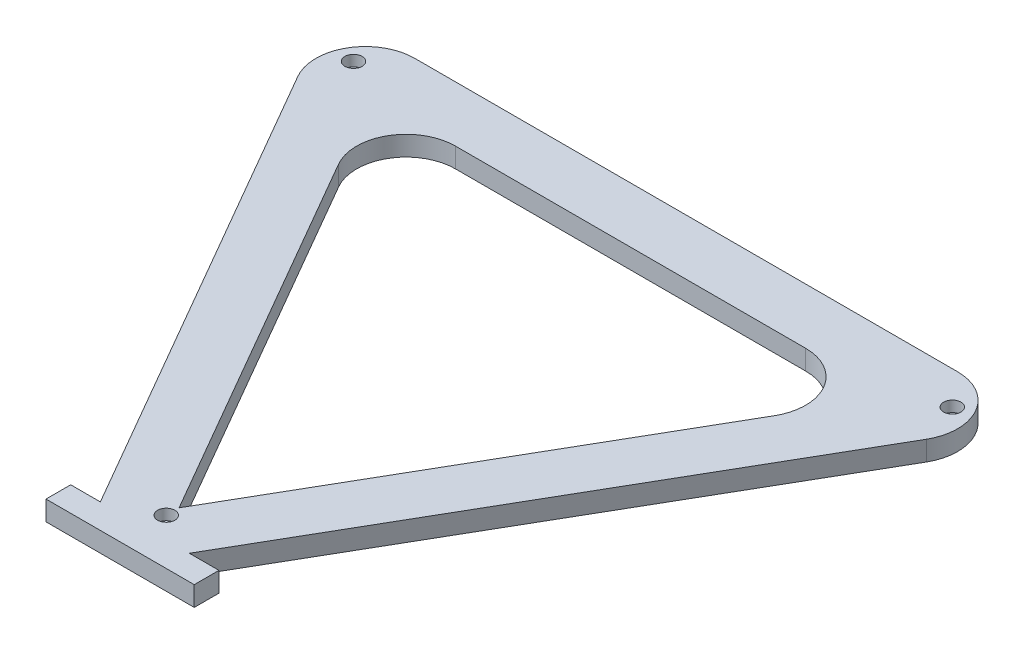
ISO-10303-21;
HEADER;
FILE_DESCRIPTION(('STEP AP214'),'2;1');
FILE_NAME('part.step','',(''),(''),'','','');
FILE_SCHEMA(('AUTOMOTIVE_DESIGN { 1 0 10303 214 1 1 1 1 }'));
ENDSEC;
DATA;
#1=APPLICATION_CONTEXT('core data for automotive mechanical design processes');
#2=APPLICATION_PROTOCOL_DEFINITION('international standard','automotive_design',2000,#1);
#3=PRODUCT_CONTEXT('',#1,'mechanical');
#4=PRODUCT('Part','Part','',(#3));
#5=PRODUCT_RELATED_PRODUCT_CATEGORY('part','',(#4));
#6=PRODUCT_DEFINITION_FORMATION('','',#4);
#7=PRODUCT_DEFINITION_CONTEXT('part definition',#1,'design');
#8=PRODUCT_DEFINITION('design','',#6,#7);
#9=PRODUCT_DEFINITION_SHAPE('','',#8);
#10=(LENGTH_UNIT() NAMED_UNIT(*) SI_UNIT(.MILLI.,.METRE.));
#11=(NAMED_UNIT(*) PLANE_ANGLE_UNIT() SI_UNIT($,.RADIAN.));
#12=(NAMED_UNIT(*) SI_UNIT($,.STERADIAN.) SOLID_ANGLE_UNIT());
#13=UNCERTAINTY_MEASURE_WITH_UNIT(LENGTH_MEASURE(1.E-05),#10,'distance_accuracy_value','');
#14=(GEOMETRIC_REPRESENTATION_CONTEXT(3) GLOBAL_UNCERTAINTY_ASSIGNED_CONTEXT((#13)) GLOBAL_UNIT_ASSIGNED_CONTEXT((#10,
#11,#12)) REPRESENTATION_CONTEXT('',''));
#15=CARTESIAN_POINT('',(0.,0.,0.));
#16=DIRECTION('',(0.,0.,1.));
#17=DIRECTION('',(1.,0.,0.));
#18=AXIS2_PLACEMENT_3D('',#15,#16,#17);
#19=CARTESIAN_POINT('',(13.3772529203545,4.,-25.5556182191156));
#20=DIRECTION('',(0.,1.,0.));
#21=DIRECTION('',(0.,0.,1.));
#22=AXIS2_PLACEMENT_3D('',#19,#20,#21);
#23=PLANE('',#22);
#24=CARTESIAN_POINT('',(-41.5522390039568,4.,69.6664683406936));
#25=DIRECTION('',(0.,1.,0.));
#26=DIRECTION('',(0.,0.,1.));
#27=AXIS2_PLACEMENT_3D('',#24,#25,#26);
#28=CIRCLE('',#27,1.75);
#29=CARTESIAN_POINT('',(-41.5522390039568,4.,71.4164683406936));
#30=VERTEX_POINT('',#29);
#31=EDGE_CURVE('E692',#30,#30,#28,.T.);
#32=ORIENTED_EDGE('',*,*,#31,.F.);
#33=EDGE_LOOP('',(#32));
#34=FACE_BOUND('',#33,.T.);
#35=CARTESIAN_POINT('',(-102.141984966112,4.,-28.8235674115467));
#36=DIRECTION('',(0.,1.,0.));
#37=DIRECTION('',(0.,0.,1.));
#38=AXIS2_PLACEMENT_3D('',#35,#36,#37);
#39=CIRCLE('',#38,1.75);
#40=CARTESIAN_POINT('',(-102.141984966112,4.,-27.0735674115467));
#41=VERTEX_POINT('',#40);
#42=EDGE_CURVE('E696',#41,#41,#39,.T.);
#43=ORIENTED_EDGE('',*,*,#42,.F.);
#44=EDGE_LOOP('',(#43));
#45=FACE_BOUND('',#44,.T.);
#46=CARTESIAN_POINT('',(19.0375069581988,4.,-28.8235674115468));
#47=DIRECTION('',(0.,1.,0.));
#48=DIRECTION('',(0.,0.,1.));
#49=AXIS2_PLACEMENT_3D('',#46,#47,#48);
#50=CIRCLE('',#49,1.75);
#51=CARTESIAN_POINT('',(19.0375069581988,4.,-27.0735674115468));
#52=VERTEX_POINT('',#51);
#53=EDGE_CURVE('E706',#52,#52,#50,.T.);
#54=ORIENTED_EDGE('',*,*,#53,.F.);
#55=EDGE_LOOP('',(#54));
#56=FACE_BOUND('',#55,.T.);
#57=CARTESIAN_POINT('',(13.3772529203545,4.,-25.5556182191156));
#58=DIRECTION('',(0.,1.,0.));
#59=DIRECTION('',(0.,0.,1.));
#60=AXIS2_PLACEMENT_3D('',#57,#58,#59);
#61=CIRCLE('',#60,10.);
#62=CARTESIAN_POINT('',(22.0375069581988,4.,-20.5556182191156));
#63=VERTEX_POINT('',#62);
#64=CARTESIAN_POINT('',(13.3772529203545,4.,-35.5556182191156));
#65=VERTEX_POINT('',#64);
#66=EDGE_CURVE('E278',#63,#65,#61,.T.);
#67=ORIENTED_EDGE('',*,*,#66,.T.);
#68=DIRECTION('',(1.,0.,0.));
#69=VECTOR('',#68,1.);
#70=CARTESIAN_POINT('',(-96.4817309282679,4.,-35.5556182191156));
#71=LINE('',#70,#69);
#72=CARTESIAN_POINT('',(-96.4817309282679,4.,-35.5556182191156));
#73=VERTEX_POINT('',#72);
#74=EDGE_CURVE('E281',#73,#65,#71,.T.);
#75=ORIENTED_EDGE('',*,*,#74,.F.);
#76=CARTESIAN_POINT('',(-96.4817309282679,4.,-25.5556182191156));
#77=DIRECTION('',(0.,1.,0.));
#78=DIRECTION('',(0.,0.,1.));
#79=AXIS2_PLACEMENT_3D('',#76,#77,#78);
#80=CIRCLE('',#79,10.);
#81=CARTESIAN_POINT('',(-105.141984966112,4.,-20.5556182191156));
#82=VERTEX_POINT('',#81);
#83=EDGE_CURVE('E286',#73,#82,#80,.T.);
#84=ORIENTED_EDGE('',*,*,#83,.T.);
#85=DIRECTION('',(-0.5,0.,-0.866025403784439));
#86=VECTOR('',#85,1.);
#87=CARTESIAN_POINT('',(-50.5522390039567,4.,73.9965953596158));
#88=LINE('',#87,#86);
#89=CARTESIAN_POINT('',(-50.5522390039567,4.,73.9965953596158));
#90=VERTEX_POINT('',#89);
#91=EDGE_CURVE('E289',#90,#82,#88,.T.);
#92=ORIENTED_EDGE('',*,*,#91,.F.);
#93=DIRECTION('',(-1.,0.,0.));
#94=VECTOR('',#93,1.);
#95=CARTESIAN_POINT('',(-50.5522390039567,4.,73.9965953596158));
#96=LINE('',#95,#94);
#97=CARTESIAN_POINT('',(-56.5522390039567,4.,73.9965953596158));
#98=VERTEX_POINT('',#97);
#99=EDGE_CURVE('E293',#90,#98,#96,.T.);
#100=ORIENTED_EDGE('',*,*,#99,.T.);
#101=DIRECTION('',(0.,0.,-1.));
#102=VECTOR('',#101,1.);
#103=CARTESIAN_POINT('',(-56.5522390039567,4.,78.9965953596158));
#104=LINE('',#103,#102);
#105=CARTESIAN_POINT('',(-56.5522390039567,4.,78.9965953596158));
#106=VERTEX_POINT('',#105);
#107=EDGE_CURVE('E296',#106,#98,#104,.T.);
#108=ORIENTED_EDGE('',*,*,#107,.F.);
#109=DIRECTION('',(-1.,0.,0.));
#110=VECTOR('',#109,1.);
#111=CARTESIAN_POINT('',(-46.5522390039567,4.,78.9965953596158));
#112=LINE('',#111,#110);
#113=CARTESIAN_POINT('',(-26.5522390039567,4.,78.9965953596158));
#114=VERTEX_POINT('',#113);
#115=EDGE_CURVE('E300',#114,#106,#112,.T.);
#116=ORIENTED_EDGE('',*,*,#115,.F.);
#117=DIRECTION('',(0.,0.,-1.));
#118=VECTOR('',#117,1.);
#119=CARTESIAN_POINT('',(-26.5522390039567,4.,78.9965953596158));
#120=LINE('',#119,#118);
#121=CARTESIAN_POINT('',(-26.5522390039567,4.,73.9965953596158));
#122=VERTEX_POINT('',#121);
#123=EDGE_CURVE('E304',#114,#122,#120,.T.);
#124=ORIENTED_EDGE('',*,*,#123,.T.);
#125=DIRECTION('',(-1.,0.,0.));
#126=VECTOR('',#125,1.);
#127=CARTESIAN_POINT('',(-26.5522390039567,4.,73.9965953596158));
#128=LINE('',#127,#126);
#129=CARTESIAN_POINT('',(-32.5522390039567,4.,73.9965953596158));
#130=VERTEX_POINT('',#129);
#131=EDGE_CURVE('E307',#122,#130,#128,.T.);
#132=ORIENTED_EDGE('',*,*,#131,.T.);
#133=DIRECTION('',(-0.5,0.,0.866025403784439));
#134=VECTOR('',#133,1.);
#135=CARTESIAN_POINT('',(22.0375069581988,4.,-20.5556182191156));
#136=LINE('',#135,#134);
#137=EDGE_CURVE('E310',#63,#130,#136,.T.);
#138=ORIENTED_EDGE('',*,*,#137,.F.);
#139=EDGE_LOOP('',(#67,#75,#84,#92,#100,#108,#116,#124,#132,#138));
#140=FACE_BOUND('',#139,.T.);
#141=DIRECTION('',(1.,0.,0.));
#142=VECTOR('',#141,1.);
#143=CARTESIAN_POINT('',(-76.9817309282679,4.,-24.2972879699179));
#144=LINE('',#143,#142);
#145=CARTESIAN_POINT('',(-76.9817309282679,4.,-24.2972879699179));
#146=VERTEX_POINT('',#145);
#147=CARTESIAN_POINT('',(-6.12274707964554,4.,-24.2972879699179));
#148=VERTEX_POINT('',#147);
#149=EDGE_CURVE('E225',#146,#148,#144,.T.);
#150=ORIENTED_EDGE('',*,*,#149,.T.);
#151=CARTESIAN_POINT('',(-6.12274707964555,4.,-14.2972879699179));
#152=DIRECTION('',(0.,1.,0.));
#153=DIRECTION('',(0.,0.,1.));
#154=AXIS2_PLACEMENT_3D('',#151,#152,#153);
#155=CIRCLE('',#154,10.);
#156=CARTESIAN_POINT('',(2.53750695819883,4.,-9.29728796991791));
#157=VERTEX_POINT('',#156);
#158=EDGE_CURVE('E216',#157,#148,#155,.T.);
#159=ORIENTED_EDGE('',*,*,#158,.F.);
#160=DIRECTION('',(-0.5,0.,0.866025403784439));
#161=VECTOR('',#160,1.);
#162=CARTESIAN_POINT('',(2.53750695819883,4.,-9.29728796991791));
#163=LINE('',#162,#161);
#164=CARTESIAN_POINT('',(-41.5522390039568,4.,67.0683921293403));
#165=VERTEX_POINT('',#164);
#166=EDGE_CURVE('E249',#157,#165,#163,.T.);
#167=ORIENTED_EDGE('',*,*,#166,.T.);
#168=DIRECTION('',(-0.5,0.,-0.866025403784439));
#169=VECTOR('',#168,1.);
#170=CARTESIAN_POINT('',(-41.5522390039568,4.,67.0683921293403));
#171=LINE('',#170,#169);
#172=CARTESIAN_POINT('',(-85.6419849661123,4.,-9.29728796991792));
#173=VERTEX_POINT('',#172);
#174=EDGE_CURVE('E124',#165,#173,#171,.T.);
#175=ORIENTED_EDGE('',*,*,#174,.T.);
#176=CARTESIAN_POINT('',(-76.9817309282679,4.,-14.2972879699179));
#177=DIRECTION('',(0.,1.,0.));
#178=DIRECTION('',(0.,0.,1.));
#179=AXIS2_PLACEMENT_3D('',#176,#177,#178);
#180=CIRCLE('',#179,10.);
#181=EDGE_CURVE('E240',#146,#173,#180,.T.);
#182=ORIENTED_EDGE('',*,*,#181,.F.);
#183=EDGE_LOOP('',(#150,#159,#167,#175,#182));
#184=FACE_BOUND('',#183,.T.);
#185=ADVANCED_FACE('F108',(#34,#45,#56,#140,#184),#23,.T.);
#186=CARTESIAN_POINT('',(13.3772529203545,0.,-25.5556182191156));
#187=DIRECTION('',(0.,1.,0.));
#188=DIRECTION('',(0.,0.,1.));
#189=AXIS2_PLACEMENT_3D('',#186,#187,#188);
#190=PLANE('',#189);
#191=CARTESIAN_POINT('',(13.3772529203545,0.,-25.5556182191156));
#192=DIRECTION('',(0.,1.,0.));
#193=DIRECTION('',(0.,0.,1.));
#194=AXIS2_PLACEMENT_3D('',#191,#192,#193);
#195=CIRCLE('',#194,10.);
#196=CARTESIAN_POINT('',(22.0375069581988,0.,-20.5556182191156));
#197=VERTEX_POINT('',#196);
#198=CARTESIAN_POINT('',(13.3772529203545,0.,-35.5556182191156));
#199=VERTEX_POINT('',#198);
#200=EDGE_CURVE('E237',#197,#199,#195,.T.);
#201=ORIENTED_EDGE('',*,*,#200,.F.);
#202=DIRECTION('',(-0.5,0.,0.866025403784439));
#203=VECTOR('',#202,1.);
#204=CARTESIAN_POINT('',(22.0375069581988,0.,-20.5556182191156));
#205=LINE('',#204,#203);
#206=CARTESIAN_POINT('',(-32.5522390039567,0.,73.9965953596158));
#207=VERTEX_POINT('',#206);
#208=EDGE_CURVE('E282',#197,#207,#205,.T.);
#209=ORIENTED_EDGE('',*,*,#208,.T.);
#210=DIRECTION('',(-1.,0.,0.));
#211=VECTOR('',#210,1.);
#212=CARTESIAN_POINT('',(-26.5522390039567,0.,73.9965953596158));
#213=LINE('',#212,#211);
#214=CARTESIAN_POINT('',(-26.5522390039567,0.,73.9965953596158));
#215=VERTEX_POINT('',#214);
#216=EDGE_CURVE('E344',#215,#207,#213,.T.);
#217=ORIENTED_EDGE('',*,*,#216,.F.);
#218=DIRECTION('',(0.,0.,-1.));
#219=VECTOR('',#218,1.);
#220=CARTESIAN_POINT('',(-26.5522390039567,0.,78.9965953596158));
#221=LINE('',#220,#219);
#222=CARTESIAN_POINT('',(-26.5522390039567,0.,78.9965953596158));
#223=VERTEX_POINT('',#222);
#224=EDGE_CURVE('E341',#223,#215,#221,.T.);
#225=ORIENTED_EDGE('',*,*,#224,.F.);
#226=DIRECTION('',(-1.,0.,0.));
#227=VECTOR('',#226,1.);
#228=CARTESIAN_POINT('',(-26.5522390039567,0.,78.9965953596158));
#229=LINE('',#228,#227);
#230=CARTESIAN_POINT('',(-56.5522390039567,0.,78.9965953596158));
#231=VERTEX_POINT('',#230);
#232=EDGE_CURVE('E338',#223,#231,#229,.T.);
#233=ORIENTED_EDGE('',*,*,#232,.T.);
#234=DIRECTION('',(0.,0.,-1.));
#235=VECTOR('',#234,1.);
#236=CARTESIAN_POINT('',(-56.5522390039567,0.,78.9965953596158));
#237=LINE('',#236,#235);
#238=CARTESIAN_POINT('',(-56.5522390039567,0.,73.9965953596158));
#239=VERTEX_POINT('',#238);
#240=EDGE_CURVE('E334',#231,#239,#237,.T.);
#241=ORIENTED_EDGE('',*,*,#240,.T.);
#242=DIRECTION('',(-1.,0.,0.));
#243=VECTOR('',#242,1.);
#244=CARTESIAN_POINT('',(-50.5522390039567,0.,73.9965953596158));
#245=LINE('',#244,#243);
#246=CARTESIAN_POINT('',(-50.5522390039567,0.,73.9965953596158));
#247=VERTEX_POINT('',#246);
#248=EDGE_CURVE('E330',#247,#239,#245,.T.);
#249=ORIENTED_EDGE('',*,*,#248,.F.);
#250=DIRECTION('',(-0.5,0.,-0.866025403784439));
#251=VECTOR('',#250,1.);
#252=CARTESIAN_POINT('',(-50.5522390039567,0.,73.9965953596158));
#253=LINE('',#252,#251);
#254=CARTESIAN_POINT('',(-105.141984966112,0.,-20.5556182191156));
#255=VERTEX_POINT('',#254);
#256=EDGE_CURVE('E326',#247,#255,#253,.T.);
#257=ORIENTED_EDGE('',*,*,#256,.T.);
#258=CARTESIAN_POINT('',(-96.4817309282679,0.,-25.5556182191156));
#259=DIRECTION('',(0.,1.,0.));
#260=DIRECTION('',(0.,0.,1.));
#261=AXIS2_PLACEMENT_3D('',#258,#259,#260);
#262=CIRCLE('',#261,10.);
#263=CARTESIAN_POINT('',(-96.4817309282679,0.,-35.5556182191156));
#264=VERTEX_POINT('',#263);
#265=EDGE_CURVE('E322',#264,#255,#262,.T.);
#266=ORIENTED_EDGE('',*,*,#265,.F.);
#267=DIRECTION('',(1.,0.,0.));
#268=VECTOR('',#267,1.);
#269=CARTESIAN_POINT('',(-96.4817309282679,0.,-35.5556182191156));
#270=LINE('',#269,#268);
#271=EDGE_CURVE('E318',#264,#199,#270,.T.);
#272=ORIENTED_EDGE('',*,*,#271,.T.);
#273=EDGE_LOOP('',(#201,#209,#217,#225,#233,#241,#249,#257,#266,#272));
#274=FACE_BOUND('',#273,.T.);
#275=CARTESIAN_POINT('',(-6.12274707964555,0.,-14.2972879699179));
#276=DIRECTION('',(0.,1.,0.));
#277=DIRECTION('',(0.,0.,1.));
#278=AXIS2_PLACEMENT_3D('',#275,#276,#277);
#279=CIRCLE('',#278,10.);
#280=CARTESIAN_POINT('',(2.53750695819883,0.,-9.29728796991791));
#281=VERTEX_POINT('',#280);
#282=CARTESIAN_POINT('',(-6.12274707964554,0.,-24.2972879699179));
#283=VERTEX_POINT('',#282);
#284=EDGE_CURVE('E252',#281,#283,#279,.T.);
#285=ORIENTED_EDGE('',*,*,#284,.T.);
#286=DIRECTION('',(1.,0.,0.));
#287=VECTOR('',#286,1.);
#288=CARTESIAN_POINT('',(-76.9817309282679,0.,-24.2972879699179));
#289=LINE('',#288,#287);
#290=CARTESIAN_POINT('',(-76.9817309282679,0.,-24.2972879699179));
#291=VERTEX_POINT('',#290);
#292=EDGE_CURVE('E234',#291,#283,#289,.T.);
#293=ORIENTED_EDGE('',*,*,#292,.F.);
#294=CARTESIAN_POINT('',(-76.9817309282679,0.,-14.2972879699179));
#295=DIRECTION('',(0.,1.,0.));
#296=DIRECTION('',(0.,0.,1.));
#297=AXIS2_PLACEMENT_3D('',#294,#295,#296);
#298=CIRCLE('',#297,10.0000000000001);
#299=CARTESIAN_POINT('',(-85.6419849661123,0.,-9.29728796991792));
#300=VERTEX_POINT('',#299);
#301=EDGE_CURVE('E258',#291,#300,#298,.T.);
#302=ORIENTED_EDGE('',*,*,#301,.T.);
#303=DIRECTION('',(-0.5,0.,-0.866025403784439));
#304=VECTOR('',#303,1.);
#305=CARTESIAN_POINT('',(-41.5522390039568,0.,67.0683921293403));
#306=LINE('',#305,#304);
#307=CARTESIAN_POINT('',(-41.5522390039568,0.,67.0683921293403));
#308=VERTEX_POINT('',#307);
#309=EDGE_CURVE('E262',#308,#300,#306,.T.);
#310=ORIENTED_EDGE('',*,*,#309,.F.);
#311=DIRECTION('',(-0.5,0.,0.866025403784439));
#312=VECTOR('',#311,1.);
#313=CARTESIAN_POINT('',(2.53750695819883,0.,-9.29728796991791));
#314=LINE('',#313,#312);
#315=EDGE_CURVE('E226',#281,#308,#314,.T.);
#316=ORIENTED_EDGE('',*,*,#315,.F.);
#317=EDGE_LOOP('',(#285,#293,#302,#310,#316));
#318=FACE_BOUND('',#317,.T.);
#319=ADVANCED_FACE('F388',(#274,#318),#190,.F.);
#320=CARTESIAN_POINT('',(13.3772529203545,4.,-25.5556182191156));
#321=DIRECTION('',(0.,-1.,0.));
#322=DIRECTION('',(0.,0.,-1.));
#323=AXIS2_PLACEMENT_3D('',#320,#321,#322);
#324=CYLINDRICAL_SURFACE('',#323,10.);
#325=ORIENTED_EDGE('',*,*,#200,.T.);
#326=DIRECTION('',(0.,-1.,0.));
#327=VECTOR('',#326,1.);
#328=CARTESIAN_POINT('',(13.3772529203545,4.,-35.5556182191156));
#329=LINE('',#328,#327);
#330=EDGE_CURVE('E12',#65,#199,#329,.T.);
#331=ORIENTED_EDGE('',*,*,#330,.F.);
#332=ORIENTED_EDGE('',*,*,#66,.F.);
#333=DIRECTION('',(0.,-1.,0.));
#334=VECTOR('',#333,1.);
#335=CARTESIAN_POINT('',(22.0375069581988,4.,-20.5556182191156));
#336=LINE('',#335,#334);
#337=EDGE_CURVE('E314',#63,#197,#336,.T.);
#338=ORIENTED_EDGE('',*,*,#337,.T.);
#339=EDGE_LOOP('',(#325,#331,#332,#338));
#340=FACE_BOUND('',#339,.T.);
#341=ADVANCED_FACE('F110',(#340),#324,.T.);
#342=CARTESIAN_POINT('',(-96.4817309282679,4.,-35.5556182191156));
#343=DIRECTION('',(0.,0.,-1.));
#344=DIRECTION('',(-1.,0.,0.));
#345=AXIS2_PLACEMENT_3D('',#342,#343,#344);
#346=PLANE('',#345);
#347=ORIENTED_EDGE('',*,*,#271,.F.);
#348=DIRECTION('',(0.,-1.,0.));
#349=VECTOR('',#348,1.);
#350=CARTESIAN_POINT('',(-96.4817309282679,4.,-35.5556182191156));
#351=LINE('',#350,#349);
#352=EDGE_CURVE('E117',#73,#264,#351,.T.);
#353=ORIENTED_EDGE('',*,*,#352,.F.);
#354=ORIENTED_EDGE('',*,*,#74,.T.);
#355=ORIENTED_EDGE('',*,*,#330,.T.);
#356=EDGE_LOOP('',(#347,#353,#354,#355));
#357=FACE_BOUND('',#356,.T.);
#358=ADVANCED_FACE('F385',(#357),#346,.T.);
#359=CARTESIAN_POINT('',(-96.4817309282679,4.,-25.5556182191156));
#360=DIRECTION('',(0.,-1.,0.));
#361=DIRECTION('',(0.,0.,-1.));
#362=AXIS2_PLACEMENT_3D('',#359,#360,#361);
#363=CYLINDRICAL_SURFACE('',#362,10.);
#364=ORIENTED_EDGE('',*,*,#265,.T.);
#365=DIRECTION('',(0.,-1.,0.));
#366=VECTOR('',#365,1.);
#367=CARTESIAN_POINT('',(-105.141984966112,4.,-20.5556182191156));
#368=LINE('',#367,#366);
#369=EDGE_CURVE('E374',#82,#255,#368,.T.);
#370=ORIENTED_EDGE('',*,*,#369,.F.);
#371=ORIENTED_EDGE('',*,*,#83,.F.);
#372=ORIENTED_EDGE('',*,*,#352,.T.);
#373=EDGE_LOOP('',(#364,#370,#371,#372));
#374=FACE_BOUND('',#373,.T.);
#375=ADVANCED_FACE('F381',(#374),#363,.T.);
#376=CARTESIAN_POINT('',(-50.5522390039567,4.,73.9965953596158));
#377=DIRECTION('',(-0.866025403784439,0.,0.5));
#378=DIRECTION('',(0.5,0.,0.866025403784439));
#379=AXIS2_PLACEMENT_3D('',#376,#377,#378);
#380=PLANE('',#379);
#381=ORIENTED_EDGE('',*,*,#256,.F.);
#382=DIRECTION('',(0.,-1.,0.));
#383=VECTOR('',#382,1.);
#384=CARTESIAN_POINT('',(-50.5522390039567,4.,73.9965953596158));
#385=LINE('',#384,#383);
#386=EDGE_CURVE('E371',#90,#247,#385,.T.);
#387=ORIENTED_EDGE('',*,*,#386,.F.);
#388=ORIENTED_EDGE('',*,*,#91,.T.);
#389=ORIENTED_EDGE('',*,*,#369,.T.);
#390=EDGE_LOOP('',(#381,#387,#388,#389));
#391=FACE_BOUND('',#390,.T.);
#392=ADVANCED_FACE('F393',(#391),#380,.T.);
#393=CARTESIAN_POINT('',(-50.5522390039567,4.,73.9965953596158));
#394=DIRECTION('',(0.,0.,1.));
#395=DIRECTION('',(1.,0.,0.));
#396=AXIS2_PLACEMENT_3D('',#393,#394,#395);
#397=PLANE('',#396);
#398=ORIENTED_EDGE('',*,*,#248,.T.);
#399=DIRECTION('',(0.,-1.,0.));
#400=VECTOR('',#399,1.);
#401=CARTESIAN_POINT('',(-56.5522390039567,4.,73.9965953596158));
#402=LINE('',#401,#400);
#403=EDGE_CURVE('E368',#98,#239,#402,.T.);
#404=ORIENTED_EDGE('',*,*,#403,.F.);
#405=ORIENTED_EDGE('',*,*,#99,.F.);
#406=ORIENTED_EDGE('',*,*,#386,.T.);
#407=EDGE_LOOP('',(#398,#404,#405,#406));
#408=FACE_BOUND('',#407,.T.);
#409=ADVANCED_FACE('F423',(#408),#397,.F.);
#410=CARTESIAN_POINT('',(-56.5522390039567,4.,78.9965953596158));
#411=DIRECTION('',(-1.,0.,0.));
#412=DIRECTION('',(0.,0.,1.));
#413=AXIS2_PLACEMENT_3D('',#410,#411,#412);
#414=PLANE('',#413);
#415=ORIENTED_EDGE('',*,*,#240,.F.);
#416=DIRECTION('',(0.,-1.,0.));
#417=VECTOR('',#416,1.);
#418=CARTESIAN_POINT('',(-56.5522390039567,4.,78.9965953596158));
#419=LINE('',#418,#417);
#420=EDGE_CURVE('E364',#106,#231,#419,.T.);
#421=ORIENTED_EDGE('',*,*,#420,.F.);
#422=ORIENTED_EDGE('',*,*,#107,.T.);
#423=ORIENTED_EDGE('',*,*,#403,.T.);
#424=EDGE_LOOP('',(#415,#421,#422,#423));
#425=FACE_BOUND('',#424,.T.);
#426=ADVANCED_FACE('F421',(#425),#414,.T.);
#427=CARTESIAN_POINT('',(-26.5522390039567,4.,78.9965953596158));
#428=DIRECTION('',(0.,0.,1.));
#429=DIRECTION('',(1.,0.,0.));
#430=AXIS2_PLACEMENT_3D('',#427,#428,#429);
#431=PLANE('',#430);
#432=ORIENTED_EDGE('',*,*,#232,.F.);
#433=DIRECTION('',(0.,-1.,0.));
#434=VECTOR('',#433,1.);
#435=CARTESIAN_POINT('',(-26.5522390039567,4.,78.9965953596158));
#436=LINE('',#435,#434);
#437=EDGE_CURVE('E361',#114,#223,#436,.T.);
#438=ORIENTED_EDGE('',*,*,#437,.F.);
#439=ORIENTED_EDGE('',*,*,#115,.T.);
#440=ORIENTED_EDGE('',*,*,#420,.T.);
#441=EDGE_LOOP('',(#432,#438,#439,#440));
#442=FACE_BOUND('',#441,.T.);
#443=ADVANCED_FACE('F418',(#442),#431,.T.);
#444=CARTESIAN_POINT('',(-26.5522390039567,4.,78.9965953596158));
#445=DIRECTION('',(-1.,0.,0.));
#446=DIRECTION('',(0.,0.,1.));
#447=AXIS2_PLACEMENT_3D('',#444,#445,#446);
#448=PLANE('',#447);
#449=ORIENTED_EDGE('',*,*,#224,.T.);
#450=DIRECTION('',(0.,-1.,0.));
#451=VECTOR('',#450,1.);
#452=CARTESIAN_POINT('',(-26.5522390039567,4.,73.9965953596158));
#453=LINE('',#452,#451);
#454=EDGE_CURVE('E357',#122,#215,#453,.T.);
#455=ORIENTED_EDGE('',*,*,#454,.F.);
#456=ORIENTED_EDGE('',*,*,#123,.F.);
#457=ORIENTED_EDGE('',*,*,#437,.T.);
#458=EDGE_LOOP('',(#449,#455,#456,#457));
#459=FACE_BOUND('',#458,.T.);
#460=ADVANCED_FACE('F415',(#459),#448,.F.);
#461=CARTESIAN_POINT('',(-26.5522390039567,4.,73.9965953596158));
#462=DIRECTION('',(0.,0.,1.));
#463=DIRECTION('',(1.,0.,0.));
#464=AXIS2_PLACEMENT_3D('',#461,#462,#463);
#465=PLANE('',#464);
#466=ORIENTED_EDGE('',*,*,#216,.T.);
#467=DIRECTION('',(0.,-1.,0.));
#468=VECTOR('',#467,1.);
#469=CARTESIAN_POINT('',(-32.5522390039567,4.,73.9965953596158));
#470=LINE('',#469,#468);
#471=EDGE_CURVE('E354',#130,#207,#470,.T.);
#472=ORIENTED_EDGE('',*,*,#471,.F.);
#473=ORIENTED_EDGE('',*,*,#131,.F.);
#474=ORIENTED_EDGE('',*,*,#454,.T.);
#475=EDGE_LOOP('',(#466,#472,#473,#474));
#476=FACE_BOUND('',#475,.T.);
#477=ADVANCED_FACE('F410',(#476),#465,.F.);
#478=CARTESIAN_POINT('',(22.0375069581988,4.,-20.5556182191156));
#479=DIRECTION('',(0.866025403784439,0.,0.5));
#480=DIRECTION('',(0.5,0.,-0.866025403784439));
#481=AXIS2_PLACEMENT_3D('',#478,#479,#480);
#482=PLANE('',#481);
#483=ORIENTED_EDGE('',*,*,#208,.F.);
#484=ORIENTED_EDGE('',*,*,#337,.F.);
#485=ORIENTED_EDGE('',*,*,#137,.T.);
#486=ORIENTED_EDGE('',*,*,#471,.T.);
#487=EDGE_LOOP('',(#483,#484,#485,#486));
#488=FACE_BOUND('',#487,.T.);
#489=ADVANCED_FACE('F404',(#488),#482,.T.);
#490=CARTESIAN_POINT('',(-6.12274707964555,4.,-14.2972879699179));
#491=DIRECTION('',(0.,-1.,0.));
#492=DIRECTION('',(0.,0.,-1.));
#493=AXIS2_PLACEMENT_3D('',#490,#491,#492);
#494=CYLINDRICAL_SURFACE('',#493,10.);
#495=ORIENTED_EDGE('',*,*,#284,.F.);
#496=DIRECTION('',(0.,-1.,0.));
#497=VECTOR('',#496,1.);
#498=CARTESIAN_POINT('',(2.53750695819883,4.,-9.29728796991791));
#499=LINE('',#498,#497);
#500=EDGE_CURVE('E132',#157,#281,#499,.T.);
#501=ORIENTED_EDGE('',*,*,#500,.F.);
#502=ORIENTED_EDGE('',*,*,#158,.T.);
#503=DIRECTION('',(0.,-1.,0.));
#504=VECTOR('',#503,1.);
#505=CARTESIAN_POINT('',(-6.12274707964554,4.,-24.2972879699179));
#506=LINE('',#505,#504);
#507=EDGE_CURVE('E219',#148,#283,#506,.T.);
#508=ORIENTED_EDGE('',*,*,#507,.T.);
#509=EDGE_LOOP('',(#495,#501,#502,#508));
#510=FACE_BOUND('',#509,.T.);
#511=ADVANCED_FACE('F218',(#510),#494,.F.);
#512=CARTESIAN_POINT('',(-76.9817309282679,4.,-24.2972879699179));
#513=DIRECTION('',(0.,0.,-1.));
#514=DIRECTION('',(-1.,0.,0.));
#515=AXIS2_PLACEMENT_3D('',#512,#513,#514);
#516=PLANE('',#515);
#517=ORIENTED_EDGE('',*,*,#292,.T.);
#518=ORIENTED_EDGE('',*,*,#507,.F.);
#519=ORIENTED_EDGE('',*,*,#149,.F.);
#520=DIRECTION('',(0.,-1.,0.));
#521=VECTOR('',#520,1.);
#522=CARTESIAN_POINT('',(-76.9817309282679,4.,-24.2972879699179));
#523=LINE('',#522,#521);
#524=EDGE_CURVE('E238',#146,#291,#523,.T.);
#525=ORIENTED_EDGE('',*,*,#524,.T.);
#526=EDGE_LOOP('',(#517,#518,#519,#525));
#527=FACE_BOUND('',#526,.T.);
#528=ADVANCED_FACE('F230',(#527),#516,.F.);
#529=CARTESIAN_POINT('',(-76.9817309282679,4.,-14.2972879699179));
#530=DIRECTION('',(0.,-1.,0.));
#531=DIRECTION('',(0.,0.,-1.));
#532=AXIS2_PLACEMENT_3D('',#529,#530,#531);
#533=CYLINDRICAL_SURFACE('',#532,10.0000000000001);
#534=ORIENTED_EDGE('',*,*,#301,.F.);
#535=ORIENTED_EDGE('',*,*,#524,.F.);
#536=ORIENTED_EDGE('',*,*,#181,.T.);
#537=DIRECTION('',(0.,-1.,0.));
#538=VECTOR('',#537,1.);
#539=CARTESIAN_POINT('',(-85.6419849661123,4.,-9.29728796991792));
#540=LINE('',#539,#538);
#541=EDGE_CURVE('E273',#173,#300,#540,.T.);
#542=ORIENTED_EDGE('',*,*,#541,.T.);
#543=EDGE_LOOP('',(#534,#535,#536,#542));
#544=FACE_BOUND('',#543,.T.);
#545=ADVANCED_FACE('F478',(#544),#533,.F.);
#546=CARTESIAN_POINT('',(-41.5522390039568,4.,67.0683921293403));
#547=DIRECTION('',(-0.866025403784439,0.,0.5));
#548=DIRECTION('',(0.5,0.,0.866025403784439));
#549=AXIS2_PLACEMENT_3D('',#546,#547,#548);
#550=PLANE('',#549);
#551=ORIENTED_EDGE('',*,*,#309,.T.);
#552=ORIENTED_EDGE('',*,*,#541,.F.);
#553=ORIENTED_EDGE('',*,*,#174,.F.);
#554=DIRECTION('',(0.,-1.,0.));
#555=VECTOR('',#554,1.);
#556=CARTESIAN_POINT('',(-41.5522390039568,4.,67.0683921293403));
#557=LINE('',#556,#555);
#558=EDGE_CURVE('E270',#165,#308,#557,.T.);
#559=ORIENTED_EDGE('',*,*,#558,.T.);
#560=EDGE_LOOP('',(#551,#552,#553,#559));
#561=FACE_BOUND('',#560,.T.);
#562=ADVANCED_FACE('F484',(#561),#550,.F.);
#563=CARTESIAN_POINT('',(2.53750695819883,4.,-9.29728796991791));
#564=DIRECTION('',(0.866025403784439,0.,0.5));
#565=DIRECTION('',(0.5,0.,-0.866025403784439));
#566=AXIS2_PLACEMENT_3D('',#563,#564,#565);
#567=PLANE('',#566);
#568=ORIENTED_EDGE('',*,*,#315,.T.);
#569=ORIENTED_EDGE('',*,*,#558,.F.);
#570=ORIENTED_EDGE('',*,*,#166,.F.);
#571=ORIENTED_EDGE('',*,*,#500,.T.);
#572=EDGE_LOOP('',(#568,#569,#570,#571));
#573=FACE_BOUND('',#572,.T.);
#574=ADVANCED_FACE('F492',(#573),#567,.F.);
#575=CARTESIAN_POINT('',(19.0375069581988,1.8,-28.8235674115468));
#576=DIRECTION('',(0.,1.,0.));
#577=DIRECTION('',(0.,0.,1.));
#578=AXIS2_PLACEMENT_3D('',#575,#576,#577);
#579=CYLINDRICAL_SURFACE('',#578,1.75);
#580=CARTESIAN_POINT('',(19.0375069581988,1.8,-28.8235674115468));
#581=DIRECTION('',(0.,1.,0.));
#582=DIRECTION('',(0.,0.,1.));
#583=AXIS2_PLACEMENT_3D('',#580,#581,#582);
#584=CIRCLE('',#583,1.75);
#585=CARTESIAN_POINT('',(19.0375069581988,1.8,-27.0735674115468));
#586=VERTEX_POINT('',#585);
#587=EDGE_CURVE('E709',#586,#586,#584,.T.);
#588=ORIENTED_EDGE('',*,*,#587,.F.);
#589=EDGE_LOOP('',(#588));
#590=FACE_BOUND('',#589,.T.);
#591=ORIENTED_EDGE('',*,*,#53,.T.);
#592=EDGE_LOOP('',(#591));
#593=FACE_BOUND('',#592,.T.);
#594=ADVANCED_FACE('F499',(#590,#593),#579,.F.);
#595=CARTESIAN_POINT('',(19.0375069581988,1.8,-28.8235674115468));
#596=DIRECTION('',(0.,1.,0.));
#597=DIRECTION('',(0.,0.,1.));
#598=AXIS2_PLACEMENT_3D('',#595,#596,#597);
#599=PLANE('',#598);
#600=ORIENTED_EDGE('',*,*,#587,.T.);
#601=EDGE_LOOP('',(#600));
#602=FACE_BOUND('',#601,.T.);
#603=ADVANCED_FACE('F506',(#602),#599,.T.);
#604=CARTESIAN_POINT('',(-102.141984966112,1.8,-28.8235674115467));
#605=DIRECTION('',(0.,1.,0.));
#606=DIRECTION('',(0.,0.,1.));
#607=AXIS2_PLACEMENT_3D('',#604,#605,#606);
#608=CYLINDRICAL_SURFACE('',#607,1.75);
#609=CARTESIAN_POINT('',(-102.141984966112,1.8,-28.8235674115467));
#610=DIRECTION('',(0.,1.,0.));
#611=DIRECTION('',(0.,0.,1.));
#612=AXIS2_PLACEMENT_3D('',#609,#610,#611);
#613=CIRCLE('',#612,1.75);
#614=CARTESIAN_POINT('',(-102.141984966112,1.8,-27.0735674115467));
#615=VERTEX_POINT('',#614);
#616=EDGE_CURVE('E702',#615,#615,#613,.T.);
#617=ORIENTED_EDGE('',*,*,#616,.F.);
#618=EDGE_LOOP('',(#617));
#619=FACE_BOUND('',#618,.T.);
#620=ORIENTED_EDGE('',*,*,#42,.T.);
#621=EDGE_LOOP('',(#620));
#622=FACE_BOUND('',#621,.T.);
#623=ADVANCED_FACE('F514',(#619,#622),#608,.F.);
#624=CARTESIAN_POINT('',(-102.141984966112,1.8,-28.8235674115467));
#625=DIRECTION('',(0.,1.,0.));
#626=DIRECTION('',(0.,0.,1.));
#627=AXIS2_PLACEMENT_3D('',#624,#625,#626);
#628=PLANE('',#627);
#629=ORIENTED_EDGE('',*,*,#616,.T.);
#630=EDGE_LOOP('',(#629));
#631=FACE_BOUND('',#630,.T.);
#632=ADVANCED_FACE('F522',(#631),#628,.T.);
#633=CARTESIAN_POINT('',(-41.5522390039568,1.8,69.6664683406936));
#634=DIRECTION('',(0.,1.,0.));
#635=DIRECTION('',(0.,0.,1.));
#636=AXIS2_PLACEMENT_3D('',#633,#634,#635);
#637=CYLINDRICAL_SURFACE('',#636,1.75);
#638=CARTESIAN_POINT('',(-41.5522390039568,1.8,69.6664683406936));
#639=DIRECTION('',(0.,1.,0.));
#640=DIRECTION('',(0.,0.,1.));
#641=AXIS2_PLACEMENT_3D('',#638,#639,#640);
#642=CIRCLE('',#641,1.75);
#643=CARTESIAN_POINT('',(-41.5522390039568,1.8,71.4164683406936));
#644=VERTEX_POINT('',#643);
#645=EDGE_CURVE('E255',#644,#644,#642,.T.);
#646=ORIENTED_EDGE('',*,*,#645,.F.);
#647=EDGE_LOOP('',(#646));
#648=FACE_BOUND('',#647,.T.);
#649=ORIENTED_EDGE('',*,*,#31,.T.);
#650=EDGE_LOOP('',(#649));
#651=FACE_BOUND('',#650,.T.);
#652=ADVANCED_FACE('F530',(#648,#651),#637,.F.);
#653=CARTESIAN_POINT('',(-41.5522390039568,1.8,69.6664683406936));
#654=DIRECTION('',(0.,1.,0.));
#655=DIRECTION('',(0.,0.,1.));
#656=AXIS2_PLACEMENT_3D('',#653,#654,#655);
#657=PLANE('',#656);
#658=ORIENTED_EDGE('',*,*,#645,.T.);
#659=EDGE_LOOP('',(#658));
#660=FACE_BOUND('',#659,.T.);
#661=ADVANCED_FACE('F538',(#660),#657,.T.);
#662=CLOSED_SHELL('',(#185,#319,#341,#358,#375,#392,#409,#426,#443,#460,#477,#489,#511,#528,
#545,#562,#574,#594,#603,#623,#632,#652,#661));
#663=MANIFOLD_SOLID_BREP('B2',#662);
#664=ADVANCED_BREP_SHAPE_REPRESENTATION('',(#18,#663),#14);
#665=SHAPE_DEFINITION_REPRESENTATION(#9,#664);
ENDSEC;
END-ISO-10303-21;
